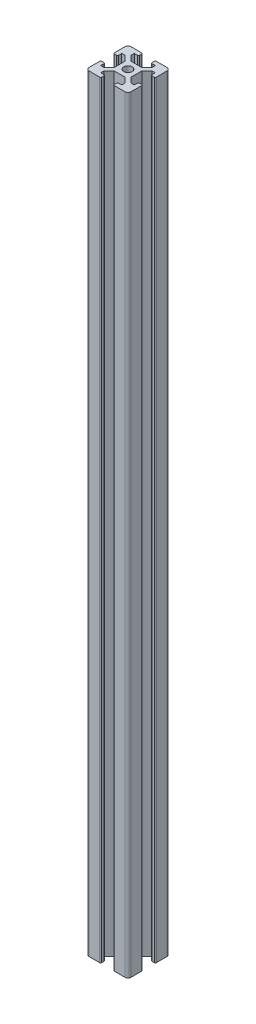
from build123d import *

# Parameters (mm, degrees)
CROQUIS1_R              = 2
SALIENTE_EXTRUIR1_DEPTH = 365
REDONDEO1_R             = 1.5
REDONDEO2_R             = 0.5


with BuildPart() as part:
    # Croquis1 → Saliente-Extruir1 (new body)
    with BuildSketch(Plane(origin=(0, 0, 0), x_dir=(1, 0, 0), z_dir=(0, 1, 0))):
        Polygon((-10, 10), (-3, 10), (-3, 8), (-5, 8), (-5, 6.414213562), (-2.585786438, 4), (2.585786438, 4), (5, 6.414213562), (5, 8), (3, 8), (3, 10), (10, 10), (10, 3), (8, 3), (8, 5), (6.414213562, 5), (4, 2.585786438), (4, -2.585786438), (6.414213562, -5), (8, -5), (8, -3), (10, -3), (10, -10), (3, -10), (3, -8), (5, -8), (5, -6.414213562), (2.585786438, -4), (-2.585786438, -4), (-5, -6.414213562), (-5, -8), (-3, -8), (-3, -10), (-10, -10), (-10, -3), (-8, -3), (-8, -5), (-6.414213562, -5), (-4, -2.585786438), (-4, 2.585786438), (-6.414213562, 5), (-8, 5), (-8, 3), (-10, 3), align=None)
        with Locations(Location((0, 0, 0), (0, 0, 90))):
            Circle(CROQUIS1_R, mode=Mode.SUBTRACT)
    extrude(amount=SALIENTE_EXTRUIR1_DEPTH)

    # Redondeo1
    redondeo1_edges = [part.edges().sort_by_distance(p)[0] for p in [
        (10, 182.5, 10),
        (-10, 182.5, 10),
        (-10, 182.5, -10),
        (10, 182.5, -10),
    ]]
    fillet(redondeo1_edges, radius=REDONDEO1_R)

    # Redondeo2
    redondeo2_edges = [part.edges().sort_by_distance(p)[0] for p in [
        (10, 182.5, -3),
        (8, 182.5, -3),
        (8, 182.5, 3),
        (10, 182.5, 3),
        (3, 182.5, 10),
        (3, 182.5, 8),
        (-3, 182.5, 8),
        (-3, 182.5, 10),
        (-10, 182.5, 3),
        (-8, 182.5, 3),
        (-8, 182.5, -3),
        (-10, 182.5, -3),
        (-3, 182.5, -10),
        (-3, 182.5, -8),
        (3, 182.5, -8),
        (3, 182.5, -10),
    ]]
    fillet(redondeo2_edges, radius=REDONDEO2_R)


solid = part.part
